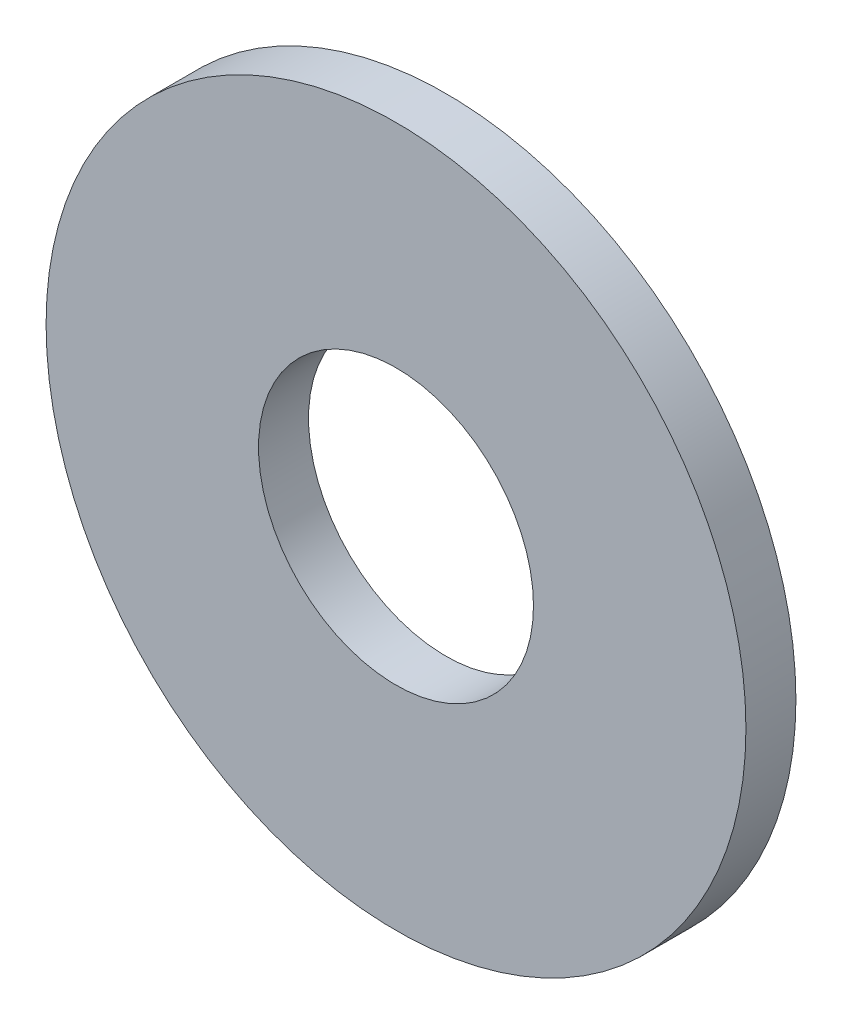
ISO-10303-21;
HEADER;
FILE_DESCRIPTION(('STEP AP214'),'2;1');
FILE_NAME('part.step','',(''),(''),'','','');
FILE_SCHEMA(('AUTOMOTIVE_DESIGN { 1 0 10303 214 1 1 1 1 }'));
ENDSEC;
DATA;
#1=APPLICATION_CONTEXT('core data for automotive mechanical design processes');
#2=APPLICATION_PROTOCOL_DEFINITION('international standard','automotive_design',2000,#1);
#3=PRODUCT_CONTEXT('',#1,'mechanical');
#4=PRODUCT('Part','Part','',(#3));
#5=PRODUCT_RELATED_PRODUCT_CATEGORY('part','',(#4));
#6=PRODUCT_DEFINITION_FORMATION('','',#4);
#7=PRODUCT_DEFINITION_CONTEXT('part definition',#1,'design');
#8=PRODUCT_DEFINITION('design','',#6,#7);
#9=PRODUCT_DEFINITION_SHAPE('','',#8);
#10=(LENGTH_UNIT() NAMED_UNIT(*) SI_UNIT(.MILLI.,.METRE.));
#11=(NAMED_UNIT(*) PLANE_ANGLE_UNIT() SI_UNIT($,.RADIAN.));
#12=(NAMED_UNIT(*) SI_UNIT($,.STERADIAN.) SOLID_ANGLE_UNIT());
#13=UNCERTAINTY_MEASURE_WITH_UNIT(LENGTH_MEASURE(1.E-05),#10,'distance_accuracy_value','');
#14=(GEOMETRIC_REPRESENTATION_CONTEXT(3) GLOBAL_UNCERTAINTY_ASSIGNED_CONTEXT((#13)) GLOBAL_UNIT_ASSIGNED_CONTEXT((#10,
#11,#12)) REPRESENTATION_CONTEXT('',''));
#15=CARTESIAN_POINT('',(0.,0.,0.));
#16=DIRECTION('',(0.,0.,1.));
#17=DIRECTION('',(1.,0.,0.));
#18=AXIS2_PLACEMENT_3D('',#15,#16,#17);
#19=CARTESIAN_POINT('',(0.,0.,2.));
#20=DIRECTION('',(0.,0.,-1.));
#21=DIRECTION('',(-1.,0.,0.));
#22=AXIS2_PLACEMENT_3D('',#19,#20,#21);
#23=CYLINDRICAL_SURFACE('',#22,14.);
#24=CARTESIAN_POINT('',(0.,0.,2.));
#25=DIRECTION('',(0.,0.,1.));
#26=DIRECTION('',(1.,0.,0.));
#27=AXIS2_PLACEMENT_3D('',#24,#25,#26);
#28=CIRCLE('',#27,14.);
#29=CARTESIAN_POINT('',(14.,0.,2.));
#30=VERTEX_POINT('',#29);
#31=EDGE_CURVE('E10',#30,#30,#28,.T.);
#32=ORIENTED_EDGE('',*,*,#31,.F.);
#33=EDGE_LOOP('',(#32));
#34=FACE_BOUND('',#33,.T.);
#35=CARTESIAN_POINT('',(0.,0.,0.));
#36=DIRECTION('',(0.,0.,1.));
#37=DIRECTION('',(1.,0.,0.));
#38=AXIS2_PLACEMENT_3D('',#35,#36,#37);
#39=CIRCLE('',#38,14.);
#40=CARTESIAN_POINT('',(14.,0.,0.));
#41=VERTEX_POINT('',#40);
#42=EDGE_CURVE('E35',#41,#41,#39,.T.);
#43=ORIENTED_EDGE('',*,*,#42,.T.);
#44=EDGE_LOOP('',(#43));
#45=FACE_BOUND('',#44,.T.);
#46=ADVANCED_FACE('F28',(#34,#45),#23,.T.);
#47=CARTESIAN_POINT('',(0.,0.,2.));
#48=DIRECTION('',(0.,0.,1.));
#49=DIRECTION('',(1.,0.,0.));
#50=AXIS2_PLACEMENT_3D('',#47,#48,#49);
#51=PLANE('',#50);
#52=CARTESIAN_POINT('',(0.,0.,2.));
#53=DIRECTION('',(0.,0.,1.));
#54=DIRECTION('',(1.,0.,0.));
#55=AXIS2_PLACEMENT_3D('',#52,#53,#54);
#56=CIRCLE('',#55,5.49999999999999);
#57=CARTESIAN_POINT('',(5.49999999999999,0.,2.));
#58=VERTEX_POINT('',#57);
#59=EDGE_CURVE('E41',#58,#58,#56,.T.);
#60=ORIENTED_EDGE('',*,*,#59,.F.);
#61=EDGE_LOOP('',(#60));
#62=FACE_BOUND('',#61,.T.);
#63=ORIENTED_EDGE('',*,*,#31,.T.);
#64=EDGE_LOOP('',(#63));
#65=FACE_BOUND('',#64,.T.);
#66=ADVANCED_FACE('F57',(#62,#65),#51,.T.);
#67=CARTESIAN_POINT('',(0.,0.,0.));
#68=DIRECTION('',(0.,0.,1.));
#69=DIRECTION('',(1.,0.,0.));
#70=AXIS2_PLACEMENT_3D('',#67,#68,#69);
#71=PLANE('',#70);
#72=CARTESIAN_POINT('',(0.,0.,0.));
#73=DIRECTION('',(0.,0.,1.));
#74=DIRECTION('',(1.,0.,0.));
#75=AXIS2_PLACEMENT_3D('',#72,#73,#74);
#76=CIRCLE('',#75,5.49999999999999);
#77=CARTESIAN_POINT('',(5.49999999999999,0.,0.));
#78=VERTEX_POINT('',#77);
#79=EDGE_CURVE('E31',#78,#78,#76,.T.);
#80=ORIENTED_EDGE('',*,*,#79,.T.);
#81=EDGE_LOOP('',(#80));
#82=FACE_BOUND('',#81,.T.);
#83=ORIENTED_EDGE('',*,*,#42,.F.);
#84=EDGE_LOOP('',(#83));
#85=FACE_BOUND('',#84,.T.);
#86=ADVANCED_FACE('F48',(#82,#85),#71,.F.);
#87=CARTESIAN_POINT('',(0.,0.,2.));
#88=DIRECTION('',(0.,0.,1.));
#89=DIRECTION('',(1.,0.,0.));
#90=AXIS2_PLACEMENT_3D('',#87,#88,#89);
#91=CYLINDRICAL_SURFACE('',#90,5.49999999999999);
#92=ORIENTED_EDGE('',*,*,#59,.T.);
#93=EDGE_LOOP('',(#92));
#94=FACE_BOUND('',#93,.T.);
#95=ORIENTED_EDGE('',*,*,#79,.F.);
#96=EDGE_LOOP('',(#95));
#97=FACE_BOUND('',#96,.T.);
#98=ADVANCED_FACE('F51',(#94,#97),#91,.F.);
#99=CLOSED_SHELL('',(#46,#66,#86,#98));
#100=MANIFOLD_SOLID_BREP('B2',#99);
#101=ADVANCED_BREP_SHAPE_REPRESENTATION('',(#18,#100),#14);
#102=SHAPE_DEFINITION_REPRESENTATION(#9,#101);
ENDSEC;
END-ISO-10303-21;
